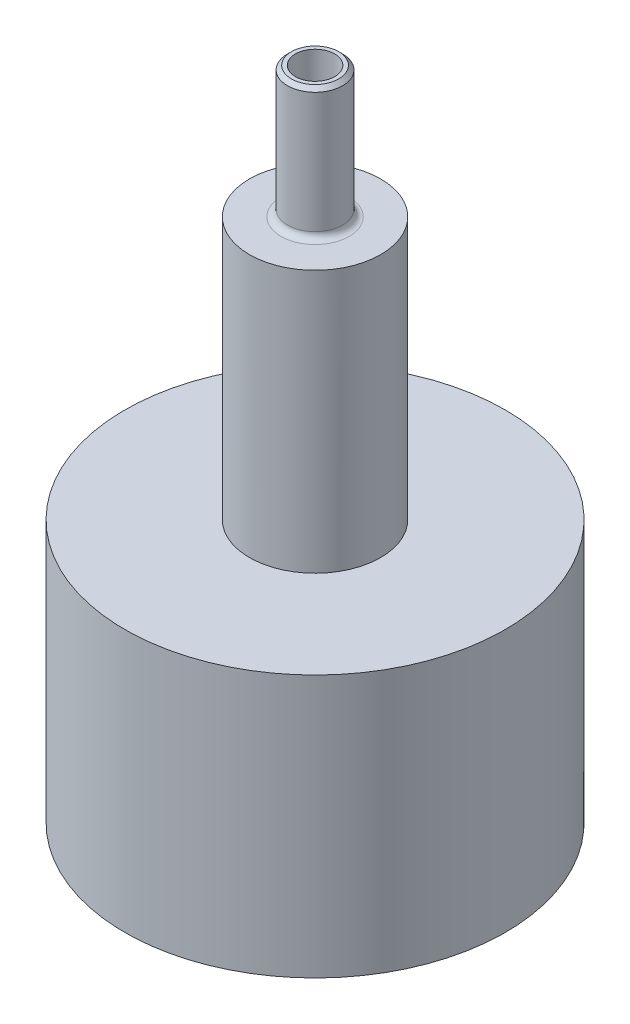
ISO-10303-21;
HEADER;
FILE_DESCRIPTION(('STEP AP214'),'2;1');
FILE_NAME('part.step','',(''),(''),'','','');
FILE_SCHEMA(('AUTOMOTIVE_DESIGN { 1 0 10303 214 1 1 1 1 }'));
ENDSEC;
DATA;
#1=APPLICATION_CONTEXT('core data for automotive mechanical design processes');
#2=APPLICATION_PROTOCOL_DEFINITION('international standard','automotive_design',2000,#1);
#3=PRODUCT_CONTEXT('',#1,'mechanical');
#4=PRODUCT('Part','Part','',(#3));
#5=PRODUCT_RELATED_PRODUCT_CATEGORY('part','',(#4));
#6=PRODUCT_DEFINITION_FORMATION('','',#4);
#7=PRODUCT_DEFINITION_CONTEXT('part definition',#1,'design');
#8=PRODUCT_DEFINITION('design','',#6,#7);
#9=PRODUCT_DEFINITION_SHAPE('','',#8);
#10=(LENGTH_UNIT() NAMED_UNIT(*) SI_UNIT(.MILLI.,.METRE.));
#11=(NAMED_UNIT(*) PLANE_ANGLE_UNIT() SI_UNIT($,.RADIAN.));
#12=(NAMED_UNIT(*) SI_UNIT($,.STERADIAN.) SOLID_ANGLE_UNIT());
#13=UNCERTAINTY_MEASURE_WITH_UNIT(LENGTH_MEASURE(1.E-05),#10,'distance_accuracy_value','');
#14=(GEOMETRIC_REPRESENTATION_CONTEXT(3) GLOBAL_UNCERTAINTY_ASSIGNED_CONTEXT((#13)) GLOBAL_UNIT_ASSIGNED_CONTEXT((#10,
#11,#12)) REPRESENTATION_CONTEXT('',''));
#15=CARTESIAN_POINT('',(0.,0.,0.));
#16=DIRECTION('',(0.,0.,1.));
#17=DIRECTION('',(1.,0.,0.));
#18=AXIS2_PLACEMENT_3D('',#15,#16,#17);
#19=CARTESIAN_POINT('',(0.,0.,0.));
#20=DIRECTION('',(0.,-1.,0.));
#21=DIRECTION('',(0.,0.,-1.));
#22=AXIS2_PLACEMENT_3D('',#19,#20,#21);
#23=CYLINDRICAL_SURFACE('',#22,5.);
#24=CARTESIAN_POINT('',(0.,19.5,0.));
#25=DIRECTION('',(0.,-1.,0.));
#26=DIRECTION('',(0.,0.,-1.));
#27=AXIS2_PLACEMENT_3D('',#24,#25,#26);
#28=CIRCLE('',#27,5.);
#29=CARTESIAN_POINT('',(0.,19.5,-5.));
#30=VERTEX_POINT('',#29);
#31=EDGE_CURVE('E46',#30,#30,#28,.T.);
#32=ORIENTED_EDGE('',*,*,#31,.F.);
#33=EDGE_LOOP('',(#32));
#34=FACE_BOUND('',#33,.T.);
#35=CARTESIAN_POINT('',(0.,39.5,0.));
#36=DIRECTION('',(0.,1.,0.));
#37=DIRECTION('',(0.,0.,1.));
#38=AXIS2_PLACEMENT_3D('',#35,#36,#37);
#39=CIRCLE('',#38,5.);
#40=CARTESIAN_POINT('',(0.,39.5,5.));
#41=VERTEX_POINT('',#40);
#42=EDGE_CURVE('E55',#41,#41,#39,.T.);
#43=ORIENTED_EDGE('',*,*,#42,.F.);
#44=EDGE_LOOP('',(#43));
#45=FACE_BOUND('',#44,.T.);
#46=ADVANCED_FACE('F14',(#34,#45),#23,.T.);
#47=CARTESIAN_POINT('',(5.,49.5,0.));
#48=DIRECTION('',(0.,1.,0.));
#49=DIRECTION('',(0.,0.,1.));
#50=AXIS2_PLACEMENT_3D('',#47,#48,#49);
#51=PLANE('',#50);
#52=CARTESIAN_POINT('',(0.,49.5,0.));
#53=DIRECTION('',(0.,1.,0.));
#54=DIRECTION('',(0.,0.,1.));
#55=AXIS2_PLACEMENT_3D('',#52,#53,#54);
#56=CIRCLE('',#55,1.8);
#57=CARTESIAN_POINT('',(0.,49.5,1.8));
#58=VERTEX_POINT('',#57);
#59=EDGE_CURVE('E29',#58,#58,#56,.T.);
#60=ORIENTED_EDGE('',*,*,#59,.T.);
#61=EDGE_LOOP('',(#60));
#62=FACE_BOUND('',#61,.T.);
#63=CARTESIAN_POINT('',(0.,49.5,0.));
#64=DIRECTION('',(0.,-1.,0.));
#65=DIRECTION('',(0.,0.,-1.));
#66=AXIS2_PLACEMENT_3D('',#63,#64,#65);
#67=CIRCLE('',#66,1.5);
#68=CARTESIAN_POINT('',(0.,49.5,-1.5));
#69=VERTEX_POINT('',#68);
#70=EDGE_CURVE('E49',#69,#69,#67,.T.);
#71=ORIENTED_EDGE('',*,*,#70,.T.);
#72=EDGE_LOOP('',(#71));
#73=FACE_BOUND('',#72,.T.);
#74=ADVANCED_FACE('F62',(#62,#73),#51,.T.);
#75=CARTESIAN_POINT('',(0.,0.,0.));
#76=DIRECTION('',(0.,-1.,0.));
#77=DIRECTION('',(0.,0.,-1.));
#78=AXIS2_PLACEMENT_3D('',#75,#76,#77);
#79=PLANE('',#78);
#80=CARTESIAN_POINT('',(0.,0.,0.));
#81=DIRECTION('',(0.,-1.,0.));
#82=DIRECTION('',(0.,0.,-1.));
#83=AXIS2_PLACEMENT_3D('',#80,#81,#82);
#84=CIRCLE('',#83,1.5);
#85=CARTESIAN_POINT('',(0.,0.,-1.5));
#86=VERTEX_POINT('',#85);
#87=EDGE_CURVE('E52',#86,#86,#84,.T.);
#88=ORIENTED_EDGE('',*,*,#87,.F.);
#89=EDGE_LOOP('',(#88));
#90=FACE_BOUND('',#89,.T.);
#91=CARTESIAN_POINT('',(0.,0.,0.));
#92=DIRECTION('',(0.,-1.,0.));
#93=DIRECTION('',(0.,0.,-1.));
#94=AXIS2_PLACEMENT_3D('',#91,#92,#93);
#95=CIRCLE('',#94,13.5);
#96=CARTESIAN_POINT('',(0.,0.,-13.5));
#97=VERTEX_POINT('',#96);
#98=EDGE_CURVE('E34',#97,#97,#95,.T.);
#99=ORIENTED_EDGE('',*,*,#98,.T.);
#100=EDGE_LOOP('',(#99));
#101=FACE_BOUND('',#100,.T.);
#102=ADVANCED_FACE('F70',(#90,#101),#79,.T.);
#103=CARTESIAN_POINT('',(0.,0.,0.));
#104=DIRECTION('',(0.,-1.,0.));
#105=DIRECTION('',(0.,0.,-1.));
#106=AXIS2_PLACEMENT_3D('',#103,#104,#105);
#107=CYLINDRICAL_SURFACE('',#106,13.5);
#108=CARTESIAN_POINT('',(0.,-0.5,0.));
#109=DIRECTION('',(0.,-1.,0.));
#110=DIRECTION('',(0.,0.,-1.));
#111=AXIS2_PLACEMENT_3D('',#108,#109,#110);
#112=CIRCLE('',#111,13.5);
#113=CARTESIAN_POINT('',(0.,-0.5,-13.5));
#114=VERTEX_POINT('',#113);
#115=EDGE_CURVE('E37',#114,#114,#112,.T.);
#116=ORIENTED_EDGE('',*,*,#115,.T.);
#117=EDGE_LOOP('',(#116));
#118=FACE_BOUND('',#117,.T.);
#119=ORIENTED_EDGE('',*,*,#98,.F.);
#120=EDGE_LOOP('',(#119));
#121=FACE_BOUND('',#120,.T.);
#122=ADVANCED_FACE('F88',(#118,#121),#107,.F.);
#123=CARTESIAN_POINT('',(13.5,-0.5,0.));
#124=DIRECTION('',(0.,-1.,0.));
#125=DIRECTION('',(0.,0.,-1.));
#126=AXIS2_PLACEMENT_3D('',#123,#124,#125);
#127=PLANE('',#126);
#128=CARTESIAN_POINT('',(0.,-0.5,0.));
#129=DIRECTION('',(0.,-1.,0.));
#130=DIRECTION('',(0.,0.,-1.));
#131=AXIS2_PLACEMENT_3D('',#128,#129,#130);
#132=CIRCLE('',#131,14.5);
#133=CARTESIAN_POINT('',(0.,-0.5,-14.5));
#134=VERTEX_POINT('',#133);
#135=EDGE_CURVE('E40',#134,#134,#132,.T.);
#136=ORIENTED_EDGE('',*,*,#135,.T.);
#137=EDGE_LOOP('',(#136));
#138=FACE_BOUND('',#137,.T.);
#139=ORIENTED_EDGE('',*,*,#115,.F.);
#140=EDGE_LOOP('',(#139));
#141=FACE_BOUND('',#140,.T.);
#142=ADVANCED_FACE('F84',(#138,#141),#127,.T.);
#143=CARTESIAN_POINT('',(0.,0.,0.));
#144=DIRECTION('',(0.,-1.,0.));
#145=DIRECTION('',(0.,0.,-1.));
#146=AXIS2_PLACEMENT_3D('',#143,#144,#145);
#147=CYLINDRICAL_SURFACE('',#146,14.5);
#148=CARTESIAN_POINT('',(0.,19.5,0.));
#149=DIRECTION('',(0.,-1.,0.));
#150=DIRECTION('',(0.,0.,-1.));
#151=AXIS2_PLACEMENT_3D('',#148,#149,#150);
#152=CIRCLE('',#151,14.5);
#153=CARTESIAN_POINT('',(0.,19.5,-14.5));
#154=VERTEX_POINT('',#153);
#155=EDGE_CURVE('E43',#154,#154,#152,.T.);
#156=ORIENTED_EDGE('',*,*,#155,.T.);
#157=EDGE_LOOP('',(#156));
#158=FACE_BOUND('',#157,.T.);
#159=ORIENTED_EDGE('',*,*,#135,.F.);
#160=EDGE_LOOP('',(#159));
#161=FACE_BOUND('',#160,.T.);
#162=ADVANCED_FACE('F80',(#158,#161),#147,.T.);
#163=CARTESIAN_POINT('',(14.5,19.5,0.));
#164=DIRECTION('',(0.,1.,0.));
#165=DIRECTION('',(0.,0.,1.));
#166=AXIS2_PLACEMENT_3D('',#163,#164,#165);
#167=PLANE('',#166);
#168=ORIENTED_EDGE('',*,*,#31,.T.);
#169=EDGE_LOOP('',(#168));
#170=FACE_BOUND('',#169,.T.);
#171=ORIENTED_EDGE('',*,*,#155,.F.);
#172=EDGE_LOOP('',(#171));
#173=FACE_BOUND('',#172,.T.);
#174=ADVANCED_FACE('F76',(#170,#173),#167,.T.);
#175=CARTESIAN_POINT('',(0.,0.,0.));
#176=DIRECTION('',(0.,-1.,0.));
#177=DIRECTION('',(0.,0.,-1.));
#178=AXIS2_PLACEMENT_3D('',#175,#176,#177);
#179=CYLINDRICAL_SURFACE('',#178,1.5);
#180=ORIENTED_EDGE('',*,*,#70,.F.);
#181=EDGE_LOOP('',(#180));
#182=FACE_BOUND('',#181,.T.);
#183=ORIENTED_EDGE('',*,*,#87,.T.);
#184=EDGE_LOOP('',(#183));
#185=FACE_BOUND('',#184,.T.);
#186=ADVANCED_FACE('F79',(#182,#185),#179,.F.);
#187=CARTESIAN_POINT('',(0.,39.5,0.));
#188=DIRECTION('',(0.,1.,0.));
#189=DIRECTION('',(0.,0.,1.));
#190=AXIS2_PLACEMENT_3D('',#187,#188,#189);
#191=PLANE('',#190);
#192=CARTESIAN_POINT('',(0.,39.5,0.));
#193=DIRECTION('',(0.,1.,0.));
#194=DIRECTION('',(0.,0.,1.));
#195=AXIS2_PLACEMENT_3D('',#192,#193,#194);
#196=CIRCLE('',#195,2.6);
#197=CARTESIAN_POINT('',(0.,39.5,2.6));
#198=VERTEX_POINT('',#197);
#199=EDGE_CURVE('E10',#198,#198,#196,.F.);
#200=ORIENTED_EDGE('',*,*,#199,.T.);
#201=EDGE_LOOP('',(#200));
#202=FACE_BOUND('',#201,.T.);
#203=ORIENTED_EDGE('',*,*,#42,.T.);
#204=EDGE_LOOP('',(#203));
#205=FACE_BOUND('',#204,.T.);
#206=ADVANCED_FACE('F59',(#202,#205),#191,.T.);
#207=CARTESIAN_POINT('',(0.,39.5,0.));
#208=DIRECTION('',(0.,1.,0.));
#209=DIRECTION('',(0.,0.,1.));
#210=AXIS2_PLACEMENT_3D('',#207,#208,#209);
#211=CYLINDRICAL_SURFACE('',#210,2.1);
#212=CARTESIAN_POINT('',(0.,40.,0.));
#213=DIRECTION('',(0.,1.,0.));
#214=DIRECTION('',(0.,0.,1.));
#215=AXIS2_PLACEMENT_3D('',#212,#213,#214);
#216=CIRCLE('',#215,2.1);
#217=CARTESIAN_POINT('',(0.,40.,2.1));
#218=VERTEX_POINT('',#217);
#219=EDGE_CURVE('E21',#218,#218,#216,.T.);
#220=ORIENTED_EDGE('',*,*,#219,.T.);
#221=EDGE_LOOP('',(#220));
#222=FACE_BOUND('',#221,.T.);
#223=CARTESIAN_POINT('',(0.,49.2,0.));
#224=DIRECTION('',(0.,1.,0.));
#225=DIRECTION('',(0.,0.,1.));
#226=AXIS2_PLACEMENT_3D('',#223,#224,#225);
#227=CIRCLE('',#226,2.1);
#228=CARTESIAN_POINT('',(0.,49.2,2.1));
#229=VERTEX_POINT('',#228);
#230=EDGE_CURVE('E25',#229,#229,#227,.F.);
#231=ORIENTED_EDGE('',*,*,#230,.T.);
#232=EDGE_LOOP('',(#231));
#233=FACE_BOUND('',#232,.T.);
#234=ADVANCED_FACE('F97',(#222,#233),#211,.T.);
#235=CARTESIAN_POINT('',(0.,49.5,0.));
#236=DIRECTION('',(0.,-1.,0.));
#237=DIRECTION('',(0.,0.,-1.));
#238=AXIS2_PLACEMENT_3D('',#235,#236,#237);
#239=CONICAL_SURFACE('',#238,1.8,0.785398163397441);
#240=ORIENTED_EDGE('',*,*,#230,.F.);
#241=EDGE_LOOP('',(#240));
#242=FACE_BOUND('',#241,.T.);
#243=ORIENTED_EDGE('',*,*,#59,.F.);
#244=EDGE_LOOP('',(#243));
#245=FACE_BOUND('',#244,.T.);
#246=ADVANCED_FACE('F95',(#242,#245),#239,.T.);
#247=CARTESIAN_POINT('',(0.,40.,0.));
#248=DIRECTION('',(0.,1.,0.));
#249=DIRECTION('',(0.,0.,1.));
#250=AXIS2_PLACEMENT_3D('',#247,#248,#249);
#251=TOROIDAL_SURFACE('',#250,2.6,0.5);
#252=ORIENTED_EDGE('',*,*,#199,.F.);
#253=EDGE_LOOP('',(#252));
#254=FACE_BOUND('',#253,.T.);
#255=ORIENTED_EDGE('',*,*,#219,.F.);
#256=EDGE_LOOP('',(#255));
#257=FACE_BOUND('',#256,.T.);
#258=ADVANCED_FACE('F16',(#254,#257),#251,.F.);
#259=CLOSED_SHELL('',(#46,#74,#102,#122,#142,#162,#174,#186,#206,#234,#246,#258));
#260=MANIFOLD_SOLID_BREP('B1',#259);
#261=ADVANCED_BREP_SHAPE_REPRESENTATION('',(#18,#260),#14);
#262=SHAPE_DEFINITION_REPRESENTATION(#9,#261);
ENDSEC;
END-ISO-10303-21;
